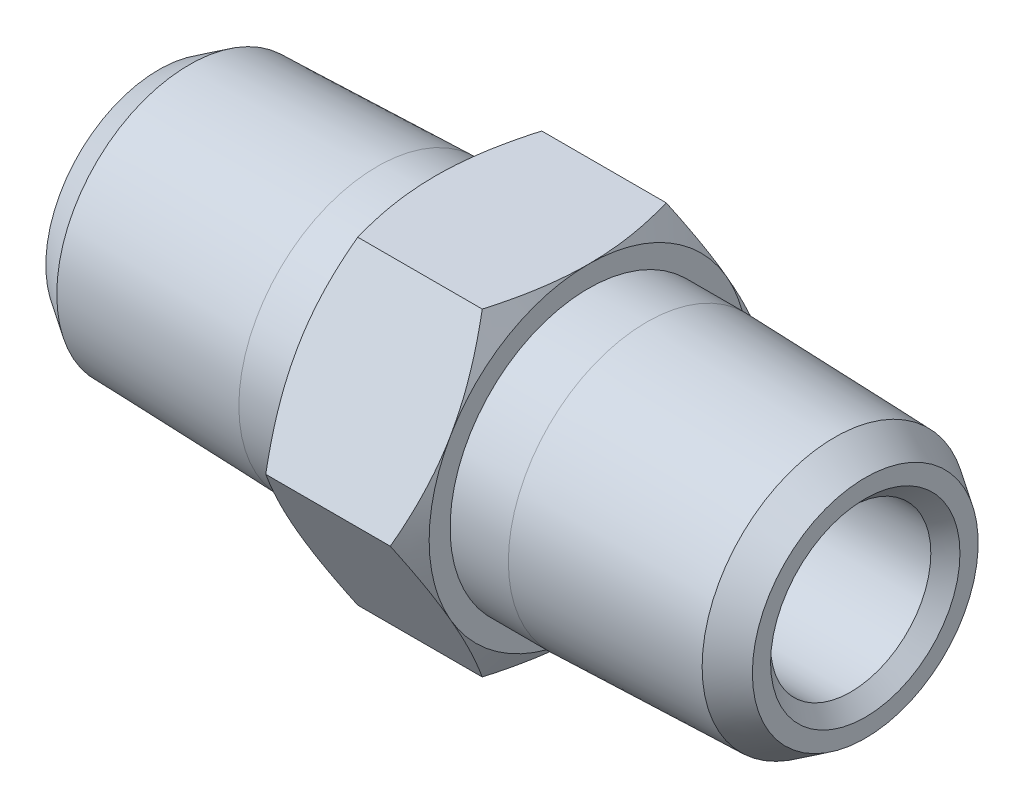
ISO-10303-21;
HEADER;
FILE_DESCRIPTION(('STEP AP214'),'2;1');
FILE_NAME('part.step','',(''),(''),'','','');
FILE_SCHEMA(('AUTOMOTIVE_DESIGN { 1 0 10303 214 1 1 1 1 }'));
ENDSEC;
DATA;
#1=APPLICATION_CONTEXT('core data for automotive mechanical design processes');
#2=APPLICATION_PROTOCOL_DEFINITION('international standard','automotive_design',2000,#1);
#3=PRODUCT_CONTEXT('',#1,'mechanical');
#4=PRODUCT('Part','Part','',(#3));
#5=PRODUCT_RELATED_PRODUCT_CATEGORY('part','',(#4));
#6=PRODUCT_DEFINITION_FORMATION('','',#4);
#7=PRODUCT_DEFINITION_CONTEXT('part definition',#1,'design');
#8=PRODUCT_DEFINITION('design','',#6,#7);
#9=PRODUCT_DEFINITION_SHAPE('','',#8);
#10=(LENGTH_UNIT() NAMED_UNIT(*) SI_UNIT(.MILLI.,.METRE.));
#11=(NAMED_UNIT(*) PLANE_ANGLE_UNIT() SI_UNIT($,.RADIAN.));
#12=(NAMED_UNIT(*) SI_UNIT($,.STERADIAN.) SOLID_ANGLE_UNIT());
#13=UNCERTAINTY_MEASURE_WITH_UNIT(LENGTH_MEASURE(1.E-05),#10,'distance_accuracy_value','');
#14=(GEOMETRIC_REPRESENTATION_CONTEXT(3) GLOBAL_UNCERTAINTY_ASSIGNED_CONTEXT((#13)) GLOBAL_UNIT_ASSIGNED_CONTEXT((#10,
#11,#12)) REPRESENTATION_CONTEXT('',''));
#15=CARTESIAN_POINT('',(0.,0.,0.));
#16=DIRECTION('',(0.,0.,1.));
#17=DIRECTION('',(1.,0.,0.));
#18=AXIS2_PLACEMENT_3D('',#15,#16,#17);
#19=CARTESIAN_POINT('',(0.,0.,-6.41580486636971));
#20=DIRECTION('',(0.,-0.5,-0.866025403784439));
#21=DIRECTION('',(0.,0.866025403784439,-0.5));
#22=AXIS2_PLACEMENT_3D('',#19,#20,#21);
#23=PLANE('',#22);
#24=CARTESIAN_POINT('',(-2.17073577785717,-2.21744281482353E-08,-6.4158048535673));
#25=CARTESIAN_POINT('',(-2.24613408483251,-0.226138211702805,-6.28524390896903));
#26=CARTESIAN_POINT('',(-2.31521209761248,-0.454087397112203,-6.15363738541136));
#27=CARTESIAN_POINT('',(-2.43702992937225,-0.911995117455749,-5.889264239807));
#28=CARTESIAN_POINT('',(-2.4898505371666,-1.14193768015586,-5.75650683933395));
#29=CARTESIAN_POINT('',(-2.55470527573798,-1.48902162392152,-5.55611783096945));
#30=CARTESIAN_POINT('',(-2.57393536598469,-1.60515471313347,-5.4890683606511));
#31=CARTESIAN_POINT('',(-2.60722305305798,-1.8379768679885,-5.35464842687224));
#32=CARTESIAN_POINT('',(-2.62128078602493,-1.95466591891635,-5.28727797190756));
#33=CARTESIAN_POINT('',(-2.64397676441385,-2.18903161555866,-5.15196687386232));
#34=CARTESIAN_POINT('',(-2.65258744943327,-2.30671027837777,-5.08402506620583));
#35=CARTESIAN_POINT('',(-2.66411098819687,-2.54229903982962,-4.94800783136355));
#36=CARTESIAN_POINT('',(-2.66702271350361,-2.66020917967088,-4.87993238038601));
#37=CARTESIAN_POINT('',(-2.66700000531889,-2.77812499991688,-4.81185364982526));
#38=B_SPLINE_CURVE_WITH_KNOTS('',3,(#24,#25,#26,#27,#28,#29,#30,#31,#32,#33,#34,#35,#36,#37),
.UNSPECIFIED.,.F.,.F.,(4,2,2,2,2,2,4),(0.,0.815698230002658,1.62727496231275,2.0335958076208,
2.43990595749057,2.84825580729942,3.25668650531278),.UNSPECIFIED.);
#39=CARTESIAN_POINT('',(-2.17073577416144,1.10872120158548E-08,-6.4158048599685));
#40=VERTEX_POINT('',#39);
#41=CARTESIAN_POINT('',(-2.66700000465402,-2.77812500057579,-4.81185365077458));
#42=VERTEX_POINT('',#41);
#43=EDGE_CURVE('E289',#40,#42,#38,.T.);
#44=ORIENTED_EDGE('',*,*,#43,.F.);
#45=DIRECTION('',(1.,0.,0.));
#46=VECTOR('',#45,1.);
#47=CARTESIAN_POINT('',(0.,0.,-6.4158048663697));
#48=LINE('',#47,#46);
#49=CARTESIAN_POINT('',(2.17073576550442,1.48838510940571E-08,-6.4158048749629));
#50=VERTEX_POINT('',#49);
#51=EDGE_CURVE('E134',#50,#40,#48,.F.);
#52=ORIENTED_EDGE('',*,*,#51,.F.);
#53=CARTESIAN_POINT('',(2.66700000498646,-2.7781249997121,-4.81185364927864));
#54=CARTESIAN_POINT('',(2.66702271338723,-2.66020917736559,-4.87993238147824));
#55=CARTESIAN_POINT('',(2.66411098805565,-2.5422990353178,-4.94800783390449));
#56=CARTESIAN_POINT('',(2.65258744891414,-2.30671026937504,-5.0840250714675));
#57=CARTESIAN_POINT('',(2.64397676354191,-2.18903160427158,-5.15196688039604));
#58=CARTESIAN_POINT('',(2.62128078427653,-1.95466590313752,-5.28727798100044));
#59=CARTESIAN_POINT('',(2.60722305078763,-1.83797685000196,-5.35464843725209));
#60=CARTESIAN_POINT('',(2.57393536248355,-1.60515469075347,-5.48906837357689));
#61=CARTESIAN_POINT('',(2.55470527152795,-1.48902159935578,-5.55611784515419));
#62=CARTESIAN_POINT('',(2.48985053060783,-1.14193764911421,-5.75650685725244));
#63=CARTESIAN_POINT('',(2.4370299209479,-0.911995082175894,-5.88926426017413));
#64=CARTESIAN_POINT('',(2.31521208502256,-0.454087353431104,-6.15363741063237));
#65=CARTESIAN_POINT('',(2.24613406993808,-0.226138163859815,-6.28524393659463));
#66=CARTESIAN_POINT('',(2.17073576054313,2.97677033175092E-08,-6.4158048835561));
#67=B_SPLINE_CURVE_WITH_KNOTS('',3,(#53,#54,#55,#56,#57,#58,#59,#60,#61,#62,#63,#64,#65,#66),
.UNSPECIFIED.,.F.,.F.,(4,2,2,2,2,2,4),(0.,0.408430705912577,0.816780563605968,1.22309072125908,
1.62941157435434,2.44098832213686,3.25668656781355),.UNSPECIFIED.);
#68=CARTESIAN_POINT('',(2.66700000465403,-2.77812500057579,-4.81185365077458));
#69=VERTEX_POINT('',#68);
#70=EDGE_CURVE('E132',#69,#50,#67,.T.);
#71=ORIENTED_EDGE('',*,*,#70,.F.);
#72=CARTESIAN_POINT('',(2.17073579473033,-5.55624992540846,-3.20790247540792));
#73=CARTESIAN_POINT('',(2.24613409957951,-5.33011174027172,-3.3384634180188));
#74=CARTESIAN_POINT('',(2.31521211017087,-5.10216255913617,-3.4700699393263));
#75=CARTESIAN_POINT('',(2.43702993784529,-4.64425484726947,-3.73444308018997));
#76=CARTESIAN_POINT('',(2.48985054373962,-4.41431228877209,-3.86720047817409));
#77=CARTESIAN_POINT('',(2.55470527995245,-4.06722835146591,-4.06758948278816));
#78=CARTESIAN_POINT('',(2.573935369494,-3.95109526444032,-4.13463895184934));
#79=CARTESIAN_POINT('',(2.60722305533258,-3.71827311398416,-4.2690588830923));
#80=CARTESIAN_POINT('',(2.62128078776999,-3.60158406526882,-4.33642933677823));
#81=CARTESIAN_POINT('',(2.64397676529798,-3.36721837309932,-4.47174043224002));
#82=CARTESIAN_POINT('',(2.65258744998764,-3.24953971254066,-4.53968223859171));
#83=CARTESIAN_POINT('',(2.66411098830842,-3.01395095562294,-4.67569947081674));
#84=CARTESIAN_POINT('',(2.66702271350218,-2.89604081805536,-4.74377492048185));
#85=CARTESIAN_POINT('',(2.6670000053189,-2.77812500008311,-4.8118536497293));
#86=B_SPLINE_CURVE_WITH_KNOTS('',3,(#72,#73,#74,#75,#76,#77,#78,#79,#80,#81,#82,#83,#84,#85),
.UNSPECIFIED.,.F.,.F.,(4,2,2,2,2,2,4),(0.,0.815698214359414,1.62727493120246,2.03359576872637,
2.43990591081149,2.84825575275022,3.25668644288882),.UNSPECIFIED.);
#87=CARTESIAN_POINT('',(2.17073576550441,-5.55625,-3.20790245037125));
#88=VERTEX_POINT('',#87);
#89=EDGE_CURVE('E20',#88,#69,#86,.T.);
#90=ORIENTED_EDGE('',*,*,#89,.F.);
#91=DIRECTION('',(1.,0.,0.));
#92=VECTOR('',#91,1.);
#93=CARTESIAN_POINT('',(0.,-5.55625,-3.20790243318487));
#94=LINE('',#93,#92);
#95=CARTESIAN_POINT('',(-2.17073578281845,-5.55624996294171,-3.20790245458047));
#96=VERTEX_POINT('',#95);
#97=EDGE_CURVE('E109',#96,#88,#94,.T.);
#98=ORIENTED_EDGE('',*,*,#97,.F.);
#99=CARTESIAN_POINT('',(-2.66700000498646,-2.7781249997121,-4.81185364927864));
#100=CARTESIAN_POINT('',(-2.66702271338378,-2.89604081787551,-4.74377492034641));
#101=CARTESIAN_POINT('',(-2.66411098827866,-3.01395095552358,-4.67569947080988));
#102=CARTESIAN_POINT('',(-2.65258745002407,-3.24953971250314,-4.53968223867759));
#103=CARTESIAN_POINT('',(-2.64397676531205,-3.36721837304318,-4.4717404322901));
#104=CARTESIAN_POINT('',(-2.62128078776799,-3.60158406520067,-4.33642933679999));
#105=CARTESIAN_POINT('',(-2.60722305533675,-3.71827311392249,-4.26905888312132));
#106=CARTESIAN_POINT('',(-2.57393536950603,-3.9510952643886,-4.13463895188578));
#107=CARTESIAN_POINT('',(-2.55470527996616,-4.06722835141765,-4.06758948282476));
#108=CARTESIAN_POINT('',(-2.48985054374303,-4.41431228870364,-3.86720047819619));
#109=CARTESIAN_POINT('',(-2.43702993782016,-4.64425484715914,-3.73444308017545));
#110=CARTESIAN_POINT('',(-2.31521211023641,-5.10216255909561,-3.47006993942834));
#111=CARTESIAN_POINT('',(-2.24613409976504,-5.3301117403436,-3.33846341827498));
#112=CARTESIAN_POINT('',(-2.17073579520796,-5.5562499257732,-3.20790247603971));
#113=B_SPLINE_CURVE_WITH_KNOTS('',3,(#99,#100,#101,#102,#103,#104,#105,#106,#107,#108,#109,#110,
#111,#112),.UNSPECIFIED.,.F.,.F.,(4,2,2,2,2,2,4),(0.,0.408430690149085,0.81678053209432,
1.22309067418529,1.62941151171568,2.44098822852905,3.25668644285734),.UNSPECIFIED.);
#114=EDGE_CURVE('E192',#42,#96,#113,.T.);
#115=ORIENTED_EDGE('',*,*,#114,.F.);
#116=EDGE_LOOP('',(#44,#52,#71,#90,#98,#115));
#117=FACE_BOUND('',#116,.T.);
#118=ADVANCED_FACE('F16',(#117),#23,.T.);
#119=CARTESIAN_POINT('',(0.,5.55625,-3.20790243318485));
#120=DIRECTION('',(0.,0.5,-0.866025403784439));
#121=DIRECTION('',(0.,0.866025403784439,0.5));
#122=AXIS2_PLACEMENT_3D('',#119,#120,#121);
#123=PLANE('',#122);
#124=CARTESIAN_POINT('',(-2.17073576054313,5.55625002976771,-3.20790241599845));
#125=CARTESIAN_POINT('',(-2.24613406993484,5.3301118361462,-3.33846336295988));
#126=CARTESIAN_POINT('',(-2.31521208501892,5.10216264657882,-3.47006988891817));
#127=CARTESIAN_POINT('',(-2.43702992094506,4.64425491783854,-3.73444303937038));
#128=CARTESIAN_POINT('',(-2.48985053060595,4.41431235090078,-3.86720044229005));
#129=CARTESIAN_POINT('',(-2.55470527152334,4.06722840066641,-4.06758945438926));
#130=CARTESIAN_POINT('',(-2.57393536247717,3.95109530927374,-4.13463892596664));
#131=CARTESIAN_POINT('',(-2.60722305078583,3.71827315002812,-4.26905886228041));
#132=CARTESIAN_POINT('',(-2.62128078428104,3.60158409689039,-4.33642931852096));
#133=CARTESIAN_POINT('',(-2.64397676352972,3.36721839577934,-4.47174041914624));
#134=CARTESIAN_POINT('',(-2.65258744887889,3.24953973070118,-4.53968222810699));
#135=CARTESIAN_POINT('',(-2.66411098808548,3.01395096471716,-4.67569946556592));
#136=CARTESIAN_POINT('',(-2.66702271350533,2.89604082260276,-4.74377491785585));
#137=CARTESIAN_POINT('',(-2.6670000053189,2.7781250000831,-4.81185364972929));
#138=B_SPLINE_CURVE_WITH_KNOTS('',3,(#124,#125,#126,#127,#128,#129,#130,#131,#132,#133,#134,
#135,#136,#137),.UNSPECIFIED.,.F.,.F.,(4,2,2,2,2,2,4),(0.,0.81569824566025,1.62727499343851,
2.03359584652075,2.43990600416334,2.84825586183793,3.25668656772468),.UNSPECIFIED.);
#139=CARTESIAN_POINT('',(-2.17073578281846,5.55625,-3.20790239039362));
#140=VERTEX_POINT('',#139);
#141=CARTESIAN_POINT('',(-2.66700000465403,2.77812500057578,-4.81185365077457));
#142=VERTEX_POINT('',#141);
#143=EDGE_CURVE('E278',#140,#142,#138,.T.);
#144=ORIENTED_EDGE('',*,*,#143,.F.);
#145=DIRECTION('',(1.,0.,0.));
#146=VECTOR('',#145,1.);
#147=CARTESIAN_POINT('',(0.,5.55625,-3.20790243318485));
#148=LINE('',#147,#146);
#149=CARTESIAN_POINT('',(2.17073576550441,5.55625001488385,-3.20790242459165));
#150=VERTEX_POINT('',#149);
#151=EDGE_CURVE('E394',#150,#140,#148,.F.);
#152=ORIENTED_EDGE('',*,*,#151,.F.);
#153=CARTESIAN_POINT('',(2.66700000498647,2.7781249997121,-4.81185364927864));
#154=CARTESIAN_POINT('',(2.66702271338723,2.89604082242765,-4.74377491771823));
#155=CARTESIAN_POINT('',(2.66411098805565,3.0139509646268,-4.67569946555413));
#156=CARTESIAN_POINT('',(2.65258744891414,3.24953973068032,-4.53968222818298));
#157=CARTESIAN_POINT('',(2.64397676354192,3.36721839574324,-4.47174041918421));
#158=CARTESIAN_POINT('',(2.62128078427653,3.60158409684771,-4.33642931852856));
#159=CARTESIAN_POINT('',(2.60722305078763,3.71827314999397,-4.26905886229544));
#160=CARTESIAN_POINT('',(2.57393536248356,3.95109530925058,-4.1346389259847));
#161=CARTESIAN_POINT('',(2.55470527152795,4.06722840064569,-4.06758945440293));
#162=CARTESIAN_POINT('',(2.48985053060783,4.41431235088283,-3.86720044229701));
#163=CARTESIAN_POINT('',(2.4370299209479,4.64425491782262,-3.73444303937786));
#164=CARTESIAN_POINT('',(2.31521208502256,5.10216264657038,-3.47006988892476));
#165=CARTESIAN_POINT('',(2.24613406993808,5.33011183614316,-3.33846336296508));
#166=CARTESIAN_POINT('',(2.17073576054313,5.5562500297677,-3.20790241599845));
#167=B_SPLINE_CURVE_WITH_KNOTS('',3,(#153,#154,#155,#156,#157,#158,#159,#160,#161,#162,#163,
#164,#165,#166),.UNSPECIFIED.,.F.,.F.,(4,2,2,2,2,2,4),(0.,0.408430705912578,0.816780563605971,
1.22309072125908,1.62941157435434,2.44098832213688,3.25668656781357),.UNSPECIFIED.);
#168=CARTESIAN_POINT('',(2.66700000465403,2.77812500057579,-4.81185365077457));
#169=VERTEX_POINT('',#168);
#170=EDGE_CURVE('E327',#169,#150,#167,.T.);
#171=ORIENTED_EDGE('',*,*,#170,.F.);
#172=CARTESIAN_POINT('',(2.17073579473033,7.38620050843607E-08,-6.41580482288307));
#173=CARTESIAN_POINT('',(2.24613409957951,0.226138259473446,-6.28524388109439));
#174=CARTESIAN_POINT('',(2.31521211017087,0.454087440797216,-6.15363736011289));
#175=CARTESIAN_POINT('',(2.4370299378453,0.911995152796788,-5.88926421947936));
#176=CARTESIAN_POINT('',(2.48985054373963,1.14193771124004,-5.7565068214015));
#177=CARTESIAN_POINT('',(2.55470527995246,1.489021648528,-5.55611781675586));
#178=CARTESIAN_POINT('',(2.573935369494,1.60515473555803,-5.48906834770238));
#179=CARTESIAN_POINT('',(2.60722305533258,1.83797688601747,-5.3546484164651));
#180=CARTESIAN_POINT('',(2.62128078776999,1.95466593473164,-5.28727796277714));
#181=CARTESIAN_POINT('',(2.64397676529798,2.1890316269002,-5.15196686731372));
#182=CARTESIAN_POINT('',(2.65258744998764,2.30671028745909,-5.08402506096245));
#183=CARTESIAN_POINT('',(2.66411098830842,2.54229904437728,-4.94800782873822));
#184=CARTESIAN_POINT('',(2.66702271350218,2.6602091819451,-4.87993237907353));
#185=CARTESIAN_POINT('',(2.6670000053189,2.77812499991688,-4.81185364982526));
#186=B_SPLINE_CURVE_WITH_KNOTS('',3,(#172,#173,#174,#175,#176,#177,#178,#179,#180,#181,#182,
#183,#184,#185),.UNSPECIFIED.,.F.,.F.,(4,2,2,2,2,2,4),(0.,0.815698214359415,1.62727493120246,
2.03359576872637,2.4399059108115,2.84825575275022,3.25668644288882),.UNSPECIFIED.);
#187=EDGE_CURVE('E128',#50,#169,#186,.T.);
#188=ORIENTED_EDGE('',*,*,#187,.F.);
#189=ORIENTED_EDGE('',*,*,#51,.T.);
#190=CARTESIAN_POINT('',(-2.66700000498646,2.7781249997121,-4.81185364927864));
#191=CARTESIAN_POINT('',(-2.66702271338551,2.66020917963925,-4.87993238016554));
#192=CARTESIAN_POINT('',(-2.66411098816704,2.54229903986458,-4.9480078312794));
#193=CARTESIAN_POINT('',(-2.65258744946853,2.306710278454,-5.08402506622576));
#194=CARTESIAN_POINT('',(-2.64397676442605,2.18903161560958,-5.15196687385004));
#195=CARTESIAN_POINT('',(-2.62128078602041,1.95466591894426,-5.2872779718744));
#196=CARTESIAN_POINT('',(-2.60722305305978,1.83797686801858,-5.35464842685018));
#197=CARTESIAN_POINT('',(-2.57393536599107,1.60515471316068,-5.48906836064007));
#198=CARTESIAN_POINT('',(-2.55470527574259,1.4890216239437,-5.55611783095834));
#199=CARTESIAN_POINT('',(-2.48985053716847,1.14193768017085,-5.75650683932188));
#200=CARTESIAN_POINT('',(-2.43702992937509,0.91199511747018,-5.88926423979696));
#201=CARTESIAN_POINT('',(-2.31521209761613,0.45408739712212,-6.15363738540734));
#202=CARTESIAN_POINT('',(-2.24613408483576,0.226138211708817,-6.28524390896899));
#203=CARTESIAN_POINT('',(-2.17073577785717,2.21744244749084E-08,-6.41580485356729));
#204=B_SPLINE_CURVE_WITH_KNOTS('',3,(#190,#191,#192,#193,#194,#195,#196,#197,#198,#199,#200,
#201,#202,#203),.UNSPECIFIED.,.F.,.F.,(4,2,2,2,2,2,4),(0.,0.408430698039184,0.816780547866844,
1.22309069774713,1.6294115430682,2.44098827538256,3.25668650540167),.UNSPECIFIED.);
#205=EDGE_CURVE('E293',#142,#40,#204,.T.);
#206=ORIENTED_EDGE('',*,*,#205,.F.);
#207=EDGE_LOOP('',(#144,#152,#171,#188,#189,#206));
#208=FACE_BOUND('',#207,.T.);
#209=ADVANCED_FACE('F300',(#208),#123,.T.);
#210=CARTESIAN_POINT('',(0.,5.55625,3.20790243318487));
#211=DIRECTION('',(0.,1.,0.));
#212=DIRECTION('',(0.,0.,1.));
#213=AXIS2_PLACEMENT_3D('',#210,#211,#212);
#214=PLANE('',#213);
#215=CARTESIAN_POINT('',(-2.17073579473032,5.55624999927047,3.20790234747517));
#216=CARTESIAN_POINT('',(-2.2461340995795,5.55624999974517,2.9467804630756));
#217=CARTESIAN_POINT('',(-2.31521211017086,5.5562499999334,2.6835674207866));
#218=CARTESIAN_POINT('',(-2.43702993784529,5.55625000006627,2.1548211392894));
#219=CARTESIAN_POINT('',(-2.48985054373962,5.55625000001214,1.88930634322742));
#220=CARTESIAN_POINT('',(-2.55470527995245,5.55624999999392,1.48852833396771));
#221=CARTESIAN_POINT('',(-2.57393536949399,5.55624999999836,1.35442939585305));
#222=CARTESIAN_POINT('',(-2.60722305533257,5.55625000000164,1.08558953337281));
#223=CARTESIAN_POINT('',(-2.62128078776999,5.55625000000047,0.950848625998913));
#224=CARTESIAN_POINT('',(-2.64397676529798,5.55624999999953,0.680226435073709));
#225=CARTESIAN_POINT('',(-2.65258744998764,5.55624999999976,0.544342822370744));
#226=CARTESIAN_POINT('',(-2.66411098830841,5.55625000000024,0.27230835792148));
#227=CARTESIAN_POINT('',(-2.66702271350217,5.55625000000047,0.136157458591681));
#228=CARTESIAN_POINT('',(-2.66700000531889,5.55625,9.59636370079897E-11));
#229=B_SPLINE_CURVE_WITH_KNOTS('',3,(#215,#216,#217,#218,#219,#220,#221,#222,#223,#224,#225,
#226,#227,#228),.UNSPECIFIED.,.F.,.F.,(4,2,2,2,2,2,4),(0.,0.815698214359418,1.62727493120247,
2.03359576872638,2.43990591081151,2.84825575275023,3.25668644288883),.UNSPECIFIED.);
#230=CARTESIAN_POINT('',(-2.17073576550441,5.55625001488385,3.20790242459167));
#231=VERTEX_POINT('',#230);
#232=CARTESIAN_POINT('',(-2.66700000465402,5.55625000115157,0.));
#233=VERTEX_POINT('',#232);
#234=EDGE_CURVE('E258',#231,#233,#229,.T.);
#235=ORIENTED_EDGE('',*,*,#234,.F.);
#236=DIRECTION('',(1.,0.,0.));
#237=VECTOR('',#236,1.);
#238=CARTESIAN_POINT('',(0.,5.55625,3.20790243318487));
#239=LINE('',#238,#237);
#240=CARTESIAN_POINT('',(2.17073578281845,5.55625,3.20790239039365));
#241=VERTEX_POINT('',#240);
#242=EDGE_CURVE('E396',#241,#231,#239,.F.);
#243=ORIENTED_EDGE('',*,*,#242,.F.);
#244=CARTESIAN_POINT('',(2.66700000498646,5.55624999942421,0.));
#245=CARTESIAN_POINT('',(2.66702271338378,5.55624999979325,0.136157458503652));
#246=CARTESIAN_POINT('',(2.66411098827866,5.55624999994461,0.272308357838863));
#247=CARTESIAN_POINT('',(2.65258745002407,5.55625000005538,0.544342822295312));
#248=CARTESIAN_POINT('',(2.64397676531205,5.55625000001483,0.680226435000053));
#249=CARTESIAN_POINT('',(2.62128078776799,5.55624999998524,0.950848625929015));
#250=CARTESIAN_POINT('',(2.60722305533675,5.55624999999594,1.08558953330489));
#251=CARTESIAN_POINT('',(2.57393536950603,5.55625000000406,1.35442939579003));
#252=CARTESIAN_POINT('',(2.55470527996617,5.55625000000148,1.48852833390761));
#253=CARTESIAN_POINT('',(2.48985054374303,5.55624999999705,1.8893063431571));
#254=CARTESIAN_POINT('',(2.43702993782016,5.55624999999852,2.15482113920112));
#255=CARTESIAN_POINT('',(2.31521211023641,5.55625000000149,2.68356742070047));
#256=CARTESIAN_POINT('',(2.24613409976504,5.55625000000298,2.94678046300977));
#257=CARTESIAN_POINT('',(2.17073579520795,5.55625,3.20790234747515));
#258=B_SPLINE_CURVE_WITH_KNOTS('',3,(#244,#245,#246,#247,#248,#249,#250,#251,#252,#253,#254,
#255,#256,#257),.UNSPECIFIED.,.F.,.F.,(4,2,2,2,2,2,4),(0.,0.408430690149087,0.816780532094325,
1.2230906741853,1.62941151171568,2.44098822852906,3.25668644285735),.UNSPECIFIED.);
#259=CARTESIAN_POINT('',(2.66700000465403,5.55625000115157,0.));
#260=VERTEX_POINT('',#259);
#261=EDGE_CURVE('E332',#260,#241,#258,.T.);
#262=ORIENTED_EDGE('',*,*,#261,.F.);
#263=CARTESIAN_POINT('',(2.17073579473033,5.55624999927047,-3.20790234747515));
#264=CARTESIAN_POINT('',(2.2461340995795,5.55624999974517,-2.94678046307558));
#265=CARTESIAN_POINT('',(2.31521211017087,5.5562499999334,-2.68356742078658));
#266=CARTESIAN_POINT('',(2.43702993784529,5.55625000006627,-2.15482113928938));
#267=CARTESIAN_POINT('',(2.48985054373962,5.55625000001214,-1.88930634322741));
#268=CARTESIAN_POINT('',(2.55470527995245,5.55624999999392,-1.4885283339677));
#269=CARTESIAN_POINT('',(2.57393536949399,5.55624999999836,-1.35442939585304));
#270=CARTESIAN_POINT('',(2.60722305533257,5.55625000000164,-1.0855895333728));
#271=CARTESIAN_POINT('',(2.62128078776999,5.55625000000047,-0.950848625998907));
#272=CARTESIAN_POINT('',(2.64397676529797,5.55624999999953,-0.680226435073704));
#273=CARTESIAN_POINT('',(2.65258744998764,5.55624999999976,-0.54434282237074));
#274=CARTESIAN_POINT('',(2.66411098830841,5.55625000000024,-0.272308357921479));
#275=CARTESIAN_POINT('',(2.66702271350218,5.55625000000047,-0.136157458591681));
#276=CARTESIAN_POINT('',(2.66700000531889,5.55625,-9.5964062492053E-11));
#277=B_SPLINE_CURVE_WITH_KNOTS('',3,(#263,#264,#265,#266,#267,#268,#269,#270,#271,#272,#273,
#274,#275,#276),.UNSPECIFIED.,.F.,.F.,(4,2,2,2,2,2,4),(0.,0.815698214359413,1.62727493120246,
2.03359576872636,2.43990591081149,2.84825575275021,3.25668644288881),.UNSPECIFIED.);
#278=EDGE_CURVE('E137',#150,#260,#277,.T.);
#279=ORIENTED_EDGE('',*,*,#278,.F.);
#280=ORIENTED_EDGE('',*,*,#151,.T.);
#281=CARTESIAN_POINT('',(-2.66700000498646,5.55624999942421,0.));
#282=CARTESIAN_POINT('',(-2.66702271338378,5.55624999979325,-0.136157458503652));
#283=CARTESIAN_POINT('',(-2.66411098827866,5.55624999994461,-0.272308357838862));
#284=CARTESIAN_POINT('',(-2.65258745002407,5.55625000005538,-0.544342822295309));
#285=CARTESIAN_POINT('',(-2.64397676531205,5.55625000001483,-0.680226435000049));
#286=CARTESIAN_POINT('',(-2.62128078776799,5.55624999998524,-0.95084862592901));
#287=CARTESIAN_POINT('',(-2.60722305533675,5.55624999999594,-1.08558953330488));
#288=CARTESIAN_POINT('',(-2.57393536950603,5.55625000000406,-1.35442939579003));
#289=CARTESIAN_POINT('',(-2.55470527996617,5.55625000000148,-1.4885283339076));
#290=CARTESIAN_POINT('',(-2.48985054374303,5.55624999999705,-1.88930634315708));
#291=CARTESIAN_POINT('',(-2.43702993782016,5.55624999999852,-2.15482113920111));
#292=CARTESIAN_POINT('',(-2.31521211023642,5.55625000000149,-2.68356742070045));
#293=CARTESIAN_POINT('',(-2.24613409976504,5.55625000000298,-2.94678046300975));
#294=CARTESIAN_POINT('',(-2.17073579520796,5.55625,-3.20790234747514));
#295=B_SPLINE_CURVE_WITH_KNOTS('',3,(#281,#282,#283,#284,#285,#286,#287,#288,#289,#290,#291,
#292,#293,#294),.UNSPECIFIED.,.F.,.F.,(4,2,2,2,2,2,4),(0.,0.408430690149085,0.81678053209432,
1.22309067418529,1.62941151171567,2.44098822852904,3.25668644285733),.UNSPECIFIED.);
#296=EDGE_CURVE('E283',#233,#140,#295,.T.);
#297=ORIENTED_EDGE('',*,*,#296,.F.);
#298=EDGE_LOOP('',(#235,#243,#262,#279,#280,#297));
#299=FACE_BOUND('',#298,.T.);
#300=ADVANCED_FACE('F238',(#299),#214,.T.);
#301=CARTESIAN_POINT('',(0.,0.,6.41580486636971));
#302=DIRECTION('',(0.,0.5,0.866025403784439));
#303=DIRECTION('',(0.,-0.866025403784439,0.5));
#304=AXIS2_PLACEMENT_3D('',#301,#302,#303);
#305=PLANE('',#304);
#306=DIRECTION('',(1.,0.,0.));
#307=VECTOR('',#306,1.);
#308=CARTESIAN_POINT('',(0.,0.,6.41580486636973));
#309=LINE('',#308,#307);
#310=CARTESIAN_POINT('',(2.17073577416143,1.10872094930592E-08,6.41580485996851));
#311=VERTEX_POINT('',#310);
#312=CARTESIAN_POINT('',(-2.1707357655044,1.48838426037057E-08,6.41580487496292));
#313=VERTEX_POINT('',#312);
#314=EDGE_CURVE('E351',#311,#313,#309,.F.);
#315=ORIENTED_EDGE('',*,*,#314,.F.);
#316=CARTESIAN_POINT('',(2.66700000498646,2.7781249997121,4.81185364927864));
#317=CARTESIAN_POINT('',(2.66702271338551,2.66020917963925,4.87993238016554));
#318=CARTESIAN_POINT('',(2.66411098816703,2.54229903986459,4.94800783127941));
#319=CARTESIAN_POINT('',(2.65258744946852,2.306710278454,5.08402506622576));
#320=CARTESIAN_POINT('',(2.64397676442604,2.18903161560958,5.15196687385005));
#321=CARTESIAN_POINT('',(2.62128078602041,1.95466591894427,5.28727797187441));
#322=CARTESIAN_POINT('',(2.60722305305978,1.83797686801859,5.35464842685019));
#323=CARTESIAN_POINT('',(2.57393536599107,1.60515471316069,5.48906836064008));
#324=CARTESIAN_POINT('',(2.55470527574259,1.48902162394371,5.55611783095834));
#325=CARTESIAN_POINT('',(2.48985053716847,1.14193768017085,5.75650683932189));
#326=CARTESIAN_POINT('',(2.43702992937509,0.911995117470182,5.88926423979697));
#327=CARTESIAN_POINT('',(2.31521209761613,0.454087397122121,6.15363738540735));
#328=CARTESIAN_POINT('',(2.24613408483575,0.226138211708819,6.285243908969));
#329=CARTESIAN_POINT('',(2.17073577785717,2.21744253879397E-08,6.4158048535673));
#330=B_SPLINE_CURVE_WITH_KNOTS('',3,(#316,#317,#318,#319,#320,#321,#322,#323,#324,#325,#326,
#327,#328,#329),.UNSPECIFIED.,.F.,.F.,(4,2,2,2,2,2,4),(0.,0.408430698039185,0.816780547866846,
1.22309069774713,1.62941154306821,2.44098827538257,3.25668650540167),.UNSPECIFIED.);
#331=CARTESIAN_POINT('',(2.66700000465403,2.77812500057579,4.81185365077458));
#332=VERTEX_POINT('',#331);
#333=EDGE_CURVE('E224',#332,#311,#330,.T.);
#334=ORIENTED_EDGE('',*,*,#333,.F.);
#335=CARTESIAN_POINT('',(2.17073576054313,5.5562500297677,3.20790241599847));
#336=CARTESIAN_POINT('',(2.24613406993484,5.33011183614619,3.3384633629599));
#337=CARTESIAN_POINT('',(2.31521208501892,5.10216264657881,3.47006988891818));
#338=CARTESIAN_POINT('',(2.43702992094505,4.64425491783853,3.73444303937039));
#339=CARTESIAN_POINT('',(2.48985053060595,4.41431235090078,3.86720044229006));
#340=CARTESIAN_POINT('',(2.55470527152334,4.06722840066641,4.06758945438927));
#341=CARTESIAN_POINT('',(2.57393536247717,3.95109530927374,4.13463892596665));
#342=CARTESIAN_POINT('',(2.60722305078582,3.71827315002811,4.26905886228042));
#343=CARTESIAN_POINT('',(2.62128078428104,3.60158409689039,4.33642931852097));
#344=CARTESIAN_POINT('',(2.64397676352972,3.36721839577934,4.47174041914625));
#345=CARTESIAN_POINT('',(2.65258744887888,3.24953973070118,4.539682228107));
#346=CARTESIAN_POINT('',(2.66411098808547,3.01395096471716,4.67569946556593));
#347=CARTESIAN_POINT('',(2.66702271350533,2.89604082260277,4.74377491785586));
#348=CARTESIAN_POINT('',(2.66700000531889,2.77812500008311,4.81185364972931));
#349=B_SPLINE_CURVE_WITH_KNOTS('',3,(#335,#336,#337,#338,#339,#340,#341,#342,#343,#344,#345,
#346,#347,#348),.UNSPECIFIED.,.F.,.F.,(4,2,2,2,2,2,4),(0.,0.815698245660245,1.6272749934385,
2.03359584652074,2.43990600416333,2.84825586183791,3.25668656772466),.UNSPECIFIED.);
#350=EDGE_CURVE('E229',#241,#332,#349,.T.);
#351=ORIENTED_EDGE('',*,*,#350,.F.);
#352=ORIENTED_EDGE('',*,*,#242,.T.);
#353=CARTESIAN_POINT('',(-2.66700000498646,2.7781249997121,4.81185364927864));
#354=CARTESIAN_POINT('',(-2.66702271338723,2.89604082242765,4.74377491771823));
#355=CARTESIAN_POINT('',(-2.66411098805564,3.01395096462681,4.67569946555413));
#356=CARTESIAN_POINT('',(-2.65258744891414,3.24953973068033,4.53968222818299));
#357=CARTESIAN_POINT('',(-2.64397676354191,3.36721839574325,4.47174041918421));
#358=CARTESIAN_POINT('',(-2.62128078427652,3.60158409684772,4.33642931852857));
#359=CARTESIAN_POINT('',(-2.60722305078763,3.71827314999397,4.26905886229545));
#360=CARTESIAN_POINT('',(-2.57393536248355,3.95109530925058,4.13463892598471));
#361=CARTESIAN_POINT('',(-2.55470527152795,4.06722840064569,4.06758945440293));
#362=CARTESIAN_POINT('',(-2.48985053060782,4.41431235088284,3.86720044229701));
#363=CARTESIAN_POINT('',(-2.4370299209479,4.64425491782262,3.73444303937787));
#364=CARTESIAN_POINT('',(-2.31521208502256,5.10216264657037,3.47006988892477));
#365=CARTESIAN_POINT('',(-2.24613406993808,5.33011183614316,3.33846336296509));
#366=CARTESIAN_POINT('',(-2.17073576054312,5.5562500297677,3.20790241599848));
#367=B_SPLINE_CURVE_WITH_KNOTS('',3,(#353,#354,#355,#356,#357,#358,#359,#360,#361,#362,#363,
#364,#365,#366),.UNSPECIFIED.,.F.,.F.,(4,2,2,2,2,2,4),(0.,0.408430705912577,0.816780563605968,
1.22309072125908,1.62941157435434,2.44098832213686,3.25668656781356),.UNSPECIFIED.);
#368=CARTESIAN_POINT('',(-2.66700000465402,2.77812500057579,4.81185365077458));
#369=VERTEX_POINT('',#368);
#370=EDGE_CURVE('E251',#369,#231,#367,.T.);
#371=ORIENTED_EDGE('',*,*,#370,.F.);
#372=CARTESIAN_POINT('',(-2.17073579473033,7.3862004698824E-08,6.41580482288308));
#373=CARTESIAN_POINT('',(-2.2461340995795,0.226138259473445,6.2852438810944));
#374=CARTESIAN_POINT('',(-2.31521211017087,0.454087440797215,6.1536373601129));
#375=CARTESIAN_POINT('',(-2.43702993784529,0.911995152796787,5.88926421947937));
#376=CARTESIAN_POINT('',(-2.48985054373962,1.14193771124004,5.75650682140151));
#377=CARTESIAN_POINT('',(-2.55470527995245,1.489021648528,5.55611781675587));
#378=CARTESIAN_POINT('',(-2.573935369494,1.60515473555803,5.48906834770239));
#379=CARTESIAN_POINT('',(-2.60722305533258,1.83797688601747,5.35464841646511));
#380=CARTESIAN_POINT('',(-2.62128078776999,1.95466593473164,5.28727796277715));
#381=CARTESIAN_POINT('',(-2.64397676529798,2.1890316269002,5.15196686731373));
#382=CARTESIAN_POINT('',(-2.65258744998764,2.30671028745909,5.08402506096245));
#383=CARTESIAN_POINT('',(-2.66411098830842,2.54229904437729,4.94800782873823));
#384=CARTESIAN_POINT('',(-2.66702271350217,2.66020918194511,4.87993237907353));
#385=CARTESIAN_POINT('',(-2.66700000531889,2.77812499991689,4.81185364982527));
#386=B_SPLINE_CURVE_WITH_KNOTS('',3,(#372,#373,#374,#375,#376,#377,#378,#379,#380,#381,#382,
#383,#384,#385),.UNSPECIFIED.,.F.,.F.,(4,2,2,2,2,2,4),(0.,0.815698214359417,1.62727493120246,
2.03359576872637,2.4399059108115,2.84825575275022,3.25668644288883),.UNSPECIFIED.);
#387=EDGE_CURVE('E246',#313,#369,#386,.T.);
#388=ORIENTED_EDGE('',*,*,#387,.F.);
#389=EDGE_LOOP('',(#315,#334,#351,#352,#371,#388));
#390=FACE_BOUND('',#389,.T.);
#391=ADVANCED_FACE('F234',(#390),#305,.T.);
#392=CARTESIAN_POINT('',(0.,-5.55625,3.20790243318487));
#393=DIRECTION('',(0.,-0.5,0.866025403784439));
#394=DIRECTION('',(0.,-0.866025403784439,-0.5));
#395=AXIS2_PLACEMENT_3D('',#392,#393,#394);
#396=PLANE('',#395);
#397=DIRECTION('',(1.,0.,0.));
#398=VECTOR('',#397,1.);
#399=CARTESIAN_POINT('',(0.,-5.55625,3.20790243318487));
#400=LINE('',#399,#398);
#401=CARTESIAN_POINT('',(2.17073578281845,-5.55624996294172,3.20790245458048));
#402=VERTEX_POINT('',#401);
#403=CARTESIAN_POINT('',(-2.17073576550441,-5.55625,3.20790245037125));
#404=VERTEX_POINT('',#403);
#405=EDGE_CURVE('E120',#402,#404,#400,.F.);
#406=ORIENTED_EDGE('',*,*,#405,.F.);
#407=CARTESIAN_POINT('',(2.66700000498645,-2.77812499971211,4.81185364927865));
#408=CARTESIAN_POINT('',(2.66702271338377,-2.89604081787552,4.74377492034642));
#409=CARTESIAN_POINT('',(2.66411098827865,-3.01395095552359,4.6756994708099));
#410=CARTESIAN_POINT('',(2.65258745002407,-3.24953971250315,4.5396822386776));
#411=CARTESIAN_POINT('',(2.64397676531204,-3.36721837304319,4.47174043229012));
#412=CARTESIAN_POINT('',(2.62128078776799,-3.60158406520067,4.33642933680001));
#413=CARTESIAN_POINT('',(2.60722305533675,-3.7182731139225,4.26905888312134));
#414=CARTESIAN_POINT('',(2.57393536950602,-3.95109526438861,4.1346389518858));
#415=CARTESIAN_POINT('',(2.55470527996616,-4.06722835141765,4.06758948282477));
#416=CARTESIAN_POINT('',(2.48985054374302,-4.41431228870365,3.8672004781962));
#417=CARTESIAN_POINT('',(2.43702993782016,-4.64425484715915,3.73444308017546));
#418=CARTESIAN_POINT('',(2.31521211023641,-5.10216255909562,3.47006993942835));
#419=CARTESIAN_POINT('',(2.24613409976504,-5.33011174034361,3.338463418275));
#420=CARTESIAN_POINT('',(2.17073579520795,-5.55624992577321,3.20790247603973));
#421=B_SPLINE_CURVE_WITH_KNOTS('',3,(#407,#408,#409,#410,#411,#412,#413,#414,#415,#416,#417,
#418,#419,#420),.UNSPECIFIED.,.F.,.F.,(4,2,2,2,2,2,4),(0.,0.408430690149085,0.816780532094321,
1.22309067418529,1.62941151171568,2.44098822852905,3.25668644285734),.UNSPECIFIED.);
#422=CARTESIAN_POINT('',(2.66700000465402,-2.77812500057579,4.81185365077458));
#423=VERTEX_POINT('',#422);
#424=EDGE_CURVE('E193',#423,#402,#421,.T.);
#425=ORIENTED_EDGE('',*,*,#424,.F.);
#426=CARTESIAN_POINT('',(2.17073577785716,-2.21744375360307E-08,6.41580485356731));
#427=CARTESIAN_POINT('',(2.24613408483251,-0.226138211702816,6.28524390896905));
#428=CARTESIAN_POINT('',(2.31521209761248,-0.454087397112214,6.15363738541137));
#429=CARTESIAN_POINT('',(2.43702992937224,-0.911995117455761,5.88926423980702));
#430=CARTESIAN_POINT('',(2.48985053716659,-1.14193768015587,5.75650683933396));
#431=CARTESIAN_POINT('',(2.55470527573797,-1.48902162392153,5.55611783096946));
#432=CARTESIAN_POINT('',(2.57393536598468,-1.60515471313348,5.48906836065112));
#433=CARTESIAN_POINT('',(2.60722305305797,-1.83797686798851,5.35464842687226));
#434=CARTESIAN_POINT('',(2.62128078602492,-1.95466591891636,5.28727797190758));
#435=CARTESIAN_POINT('',(2.64397676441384,-2.18903161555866,5.15196687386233));
#436=CARTESIAN_POINT('',(2.65258744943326,-2.30671027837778,5.08402506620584));
#437=CARTESIAN_POINT('',(2.66411098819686,-2.54229903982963,4.94800783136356));
#438=CARTESIAN_POINT('',(2.6670227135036,-2.66020917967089,4.87993238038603));
#439=CARTESIAN_POINT('',(2.66700000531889,-2.77812499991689,4.81185364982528));
#440=B_SPLINE_CURVE_WITH_KNOTS('',3,(#426,#427,#428,#429,#430,#431,#432,#433,#434,#435,#436,
#437,#438,#439),.UNSPECIFIED.,.F.,.F.,(4,2,2,2,2,2,4),(0.,0.815698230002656,1.62727496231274,
2.0335958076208,2.43990595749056,2.84825580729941,3.25668650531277),.UNSPECIFIED.);
#441=EDGE_CURVE('E219',#311,#423,#440,.T.);
#442=ORIENTED_EDGE('',*,*,#441,.F.);
#443=ORIENTED_EDGE('',*,*,#314,.T.);
#444=CARTESIAN_POINT('',(-2.66700000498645,-2.77812499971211,4.81185364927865));
#445=CARTESIAN_POINT('',(-2.66702271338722,-2.6602091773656,4.87993238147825));
#446=CARTESIAN_POINT('',(-2.66411098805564,-2.5422990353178,4.94800783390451));
#447=CARTESIAN_POINT('',(-2.65258744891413,-2.30671026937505,5.08402507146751));
#448=CARTESIAN_POINT('',(-2.6439767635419,-2.18903160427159,5.15196688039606));
#449=CARTESIAN_POINT('',(-2.62128078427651,-1.95466590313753,5.28727798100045));
#450=CARTESIAN_POINT('',(-2.60722305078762,-1.83797685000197,5.3546484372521));
#451=CARTESIAN_POINT('',(-2.57393536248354,-1.60515469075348,5.4890683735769));
#452=CARTESIAN_POINT('',(-2.55470527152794,-1.48902159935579,5.5561178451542));
#453=CARTESIAN_POINT('',(-2.48985053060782,-1.14193764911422,5.75650685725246));
#454=CARTESIAN_POINT('',(-2.43702992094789,-0.911995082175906,5.88926426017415));
#455=CARTESIAN_POINT('',(-2.31521208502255,-0.454087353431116,6.15363741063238));
#456=CARTESIAN_POINT('',(-2.24613406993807,-0.226138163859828,6.28524393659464));
#457=CARTESIAN_POINT('',(-2.17073576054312,2.97676907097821E-08,6.41580488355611));
#458=B_SPLINE_CURVE_WITH_KNOTS('',3,(#444,#445,#446,#447,#448,#449,#450,#451,#452,#453,#454,
#455,#456,#457),.UNSPECIFIED.,.F.,.F.,(4,2,2,2,2,2,4),(0.,0.408430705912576,0.816780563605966,
1.22309072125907,1.62941157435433,2.44098832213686,3.25668656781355),.UNSPECIFIED.);
#459=CARTESIAN_POINT('',(-2.66700000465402,-2.77812500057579,4.81185365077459));
#460=VERTEX_POINT('',#459);
#461=EDGE_CURVE('E687',#460,#313,#458,.T.);
#462=ORIENTED_EDGE('',*,*,#461,.F.);
#463=CARTESIAN_POINT('',(-2.17073579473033,-5.55624992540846,3.20790247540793));
#464=CARTESIAN_POINT('',(-2.24613409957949,-5.33011174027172,3.33846341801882));
#465=CARTESIAN_POINT('',(-2.31521211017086,-5.10216255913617,3.47006993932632));
#466=CARTESIAN_POINT('',(-2.43702993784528,-4.64425484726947,3.73444308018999));
#467=CARTESIAN_POINT('',(-2.48985054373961,-4.4143122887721,3.86720047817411));
#468=CARTESIAN_POINT('',(-2.55470527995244,-4.06722835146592,4.06758948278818));
#469=CARTESIAN_POINT('',(-2.57393536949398,-3.95109526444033,4.13463895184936));
#470=CARTESIAN_POINT('',(-2.60722305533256,-3.71827311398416,4.26905888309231));
#471=CARTESIAN_POINT('',(-2.62128078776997,-3.60158406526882,4.33642933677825));
#472=CARTESIAN_POINT('',(-2.64397676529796,-3.36721837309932,4.47174043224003));
#473=CARTESIAN_POINT('',(-2.65258744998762,-3.24953971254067,4.53968223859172));
#474=CARTESIAN_POINT('',(-2.6641109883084,-3.01395095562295,4.67569947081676));
#475=CARTESIAN_POINT('',(-2.66702271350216,-2.89604081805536,4.74377492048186));
#476=CARTESIAN_POINT('',(-2.66700000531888,-2.77812500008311,4.81185364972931));
#477=B_SPLINE_CURVE_WITH_KNOTS('',3,(#463,#464,#465,#466,#467,#468,#469,#470,#471,#472,#473,
#474,#475,#476),.UNSPECIFIED.,.F.,.F.,(4,2,2,2,2,2,4),(0.,0.815698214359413,1.62727493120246,
2.03359576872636,2.43990591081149,2.84825575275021,3.25668644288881),.UNSPECIFIED.);
#478=EDGE_CURVE('E40',#404,#460,#477,.T.);
#479=ORIENTED_EDGE('',*,*,#478,.F.);
#480=EDGE_LOOP('',(#406,#425,#442,#443,#462,#479));
#481=FACE_BOUND('',#480,.T.);
#482=ADVANCED_FACE('F170',(#481),#396,.T.);
#483=CARTESIAN_POINT('',(0.,-5.55625,-3.20790243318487));
#484=DIRECTION('',(0.,-1.,0.));
#485=DIRECTION('',(0.,0.,-1.));
#486=AXIS2_PLACEMENT_3D('',#483,#484,#485);
#487=PLANE('',#486);
#488=ORIENTED_EDGE('',*,*,#97,.T.);
#489=CARTESIAN_POINT('',(2.66700000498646,-5.55624999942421,0.));
#490=CARTESIAN_POINT('',(2.66702271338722,-5.55624999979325,-0.136157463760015));
#491=CARTESIAN_POINT('',(2.66411098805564,-5.55624999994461,-0.272308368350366));
#492=CARTESIAN_POINT('',(2.65258744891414,-5.55625000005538,-0.544342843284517));
#493=CARTESIAN_POINT('',(2.64397676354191,-5.55625000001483,-0.680226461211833));
#494=CARTESIAN_POINT('',(2.62128078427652,-5.55624999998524,-0.950848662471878));
#495=CARTESIAN_POINT('',(2.60722305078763,-5.55624999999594,-1.08558957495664));
#496=CARTESIAN_POINT('',(2.57393536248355,-5.55625000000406,-1.35442944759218));
#497=CARTESIAN_POINT('',(2.55470527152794,-5.55625000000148,-1.48852839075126));
#498=CARTESIAN_POINT('',(2.48985053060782,-5.55624999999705,-1.88930641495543));
#499=CARTESIAN_POINT('',(2.43702992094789,-5.55624999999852,-2.15482122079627));
#500=CARTESIAN_POINT('',(2.31521208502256,-5.55625000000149,-2.6835675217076));
#501=CARTESIAN_POINT('',(2.24613406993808,-5.55625000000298,-2.94678057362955));
#502=CARTESIAN_POINT('',(2.17073576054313,-5.55625,-3.20790246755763));
#503=B_SPLINE_CURVE_WITH_KNOTS('',3,(#489,#490,#491,#492,#493,#494,#495,#496,#497,#498,#499,
#500,#501,#502),.UNSPECIFIED.,.F.,.F.,(4,2,2,2,2,2,4),(0.,0.408430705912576,0.816780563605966,
1.22309072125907,1.62941157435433,2.44098832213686,3.25668656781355),.UNSPECIFIED.);
#504=CARTESIAN_POINT('',(2.66700000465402,-5.55625000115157,0.));
#505=VERTEX_POINT('',#504);
#506=EDGE_CURVE('E113',#505,#88,#503,.T.);
#507=ORIENTED_EDGE('',*,*,#506,.F.);
#508=CARTESIAN_POINT('',(2.17073576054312,-5.55625,3.20790246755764));
#509=CARTESIAN_POINT('',(2.24613406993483,-5.55625,2.94678057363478));
#510=CARTESIAN_POINT('',(2.31521208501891,-5.55625,2.68356752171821));
#511=CARTESIAN_POINT('',(2.43702992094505,-5.55625,2.15482122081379));
#512=CARTESIAN_POINT('',(2.48985053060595,-5.55625,1.88930641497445));
#513=CARTESIAN_POINT('',(2.55470527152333,-5.55625,1.48852839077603));
#514=CARTESIAN_POINT('',(2.57393536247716,-5.55625,1.35442944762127));
#515=CARTESIAN_POINT('',(2.60722305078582,-5.55625,1.08558957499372));
#516=CARTESIAN_POINT('',(2.62128078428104,-5.55625,0.95084866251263));
#517=CARTESIAN_POINT('',(2.64397676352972,-5.55625,0.680226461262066));
#518=CARTESIAN_POINT('',(2.65258744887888,-5.55625,0.544342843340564));
#519=CARTESIAN_POINT('',(2.66411098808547,-5.55625,0.272308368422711));
#520=CARTESIAN_POINT('',(2.66702271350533,-5.55625,0.136157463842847));
#521=CARTESIAN_POINT('',(2.66700000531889,-5.55625,9.59610182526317E-11));
#522=B_SPLINE_CURVE_WITH_KNOTS('',3,(#508,#509,#510,#511,#512,#513,#514,#515,#516,#517,#518,
#519,#520,#521),.UNSPECIFIED.,.F.,.F.,(4,2,2,2,2,2,4),(0.,0.815698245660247,1.6272749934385,
2.03359584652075,2.43990600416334,2.84825586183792,3.25668656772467),.UNSPECIFIED.);
#523=EDGE_CURVE('E186',#402,#505,#522,.T.);
#524=ORIENTED_EDGE('',*,*,#523,.F.);
#525=ORIENTED_EDGE('',*,*,#405,.T.);
#526=CARTESIAN_POINT('',(-2.66700000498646,-5.55624999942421,0.));
#527=CARTESIAN_POINT('',(-2.66702271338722,-5.55624999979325,0.136157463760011));
#528=CARTESIAN_POINT('',(-2.66411098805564,-5.55624999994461,0.272308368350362));
#529=CARTESIAN_POINT('',(-2.65258744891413,-5.55625000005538,0.544342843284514));
#530=CARTESIAN_POINT('',(-2.6439767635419,-5.55625000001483,0.68022646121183));
#531=CARTESIAN_POINT('',(-2.62128078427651,-5.55624999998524,0.950848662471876));
#532=CARTESIAN_POINT('',(-2.60722305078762,-5.55624999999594,1.08558957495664));
#533=CARTESIAN_POINT('',(-2.57393536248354,-5.55625000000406,1.35442944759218));
#534=CARTESIAN_POINT('',(-2.55470527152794,-5.55625000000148,1.48852839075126));
#535=CARTESIAN_POINT('',(-2.48985053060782,-5.55624999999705,1.88930641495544));
#536=CARTESIAN_POINT('',(-2.43702992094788,-5.55624999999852,2.15482122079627));
#537=CARTESIAN_POINT('',(-2.31521208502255,-5.55625000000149,2.68356752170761));
#538=CARTESIAN_POINT('',(-2.24613406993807,-5.55625000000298,2.94678057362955));
#539=CARTESIAN_POINT('',(-2.17073576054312,-5.55625,3.20790246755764));
#540=B_SPLINE_CURVE_WITH_KNOTS('',3,(#526,#527,#528,#529,#530,#531,#532,#533,#534,#535,#536,
#537,#538,#539),.UNSPECIFIED.,.F.,.F.,(4,2,2,2,2,2,4),(0.,0.408430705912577,0.816780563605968,
1.22309072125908,1.62941157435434,2.44098832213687,3.25668656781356),.UNSPECIFIED.);
#541=CARTESIAN_POINT('',(-2.66700000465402,-5.55625000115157,0.));
#542=VERTEX_POINT('',#541);
#543=EDGE_CURVE('E149',#542,#404,#540,.T.);
#544=ORIENTED_EDGE('',*,*,#543,.F.);
#545=CARTESIAN_POINT('',(-2.17073576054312,-5.55625,-3.20790246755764));
#546=CARTESIAN_POINT('',(-2.24613406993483,-5.55625,-2.94678057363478));
#547=CARTESIAN_POINT('',(-2.31521208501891,-5.55625,-2.6835675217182));
#548=CARTESIAN_POINT('',(-2.43702992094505,-5.55625,-2.15482122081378));
#549=CARTESIAN_POINT('',(-2.48985053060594,-5.55625,-1.88930641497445));
#550=CARTESIAN_POINT('',(-2.55470527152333,-5.55625,-1.48852839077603));
#551=CARTESIAN_POINT('',(-2.57393536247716,-5.55625,-1.35442944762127));
#552=CARTESIAN_POINT('',(-2.60722305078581,-5.55625,-1.08558957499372));
#553=CARTESIAN_POINT('',(-2.62128078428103,-5.55625,-0.950848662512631));
#554=CARTESIAN_POINT('',(-2.64397676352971,-5.55625,-0.680226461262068));
#555=CARTESIAN_POINT('',(-2.65258744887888,-5.55625,-0.544342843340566));
#556=CARTESIAN_POINT('',(-2.66411098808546,-5.55625,-0.272308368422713));
#557=CARTESIAN_POINT('',(-2.66702271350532,-5.55625,-0.13615746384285));
#558=CARTESIAN_POINT('',(-2.66700000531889,-5.55625,-9.5964524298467E-11));
#559=B_SPLINE_CURVE_WITH_KNOTS('',3,(#545,#546,#547,#548,#549,#550,#551,#552,#553,#554,#555,
#556,#557,#558),.UNSPECIFIED.,.F.,.F.,(4,2,2,2,2,2,4),(0.,0.815698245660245,1.6272749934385,
2.03359584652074,2.43990600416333,2.84825586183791,3.25668656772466),.UNSPECIFIED.);
#560=EDGE_CURVE('E116',#96,#542,#559,.T.);
#561=ORIENTED_EDGE('',*,*,#560,.F.);
#562=EDGE_LOOP('',(#488,#507,#524,#525,#544,#561));
#563=FACE_BOUND('',#562,.T.);
#564=ADVANCED_FACE('F111',(#563),#487,.T.);
#565=CARTESIAN_POINT('',(2.16775818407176,0.,0.));
#566=DIRECTION('',(-1.,0.,0.));
#567=DIRECTION('',(0.,0.,1.));
#568=AXIS2_PLACEMENT_3D('',#565,#566,#567);
#569=CONICAL_SURFACE('',#568,6.42096219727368,1.04719755);
#570=CARTESIAN_POINT('',(2.66700000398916,0.,0.));
#571=DIRECTION('',(-1.,0.,0.));
#572=DIRECTION('',(0.,0.,1.));
#573=AXIS2_PLACEMENT_3D('',#570,#571,#572);
#574=CIRCLE('',#573,5.55625000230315);
#575=EDGE_CURVE('E127',#505,#69,#574,.F.);
#576=ORIENTED_EDGE('',*,*,#575,.F.);
#577=ORIENTED_EDGE('',*,*,#506,.T.);
#578=ORIENTED_EDGE('',*,*,#89,.T.);
#579=EDGE_LOOP('',(#576,#577,#578));
#580=FACE_BOUND('',#579,.T.);
#581=ADVANCED_FACE('F125',(#580),#569,.T.);
#582=CARTESIAN_POINT('',(2.16775818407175,0.,0.));
#583=DIRECTION('',(-1.,0.,0.));
#584=DIRECTION('',(0.,0.,1.));
#585=AXIS2_PLACEMENT_3D('',#582,#583,#584);
#586=CONICAL_SURFACE('',#585,6.42096219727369,1.04719755);
#587=CARTESIAN_POINT('',(2.66700000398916,0.,0.));
#588=DIRECTION('',(-1.,0.,0.));
#589=DIRECTION('',(0.,0.,1.));
#590=AXIS2_PLACEMENT_3D('',#587,#588,#589);
#591=CIRCLE('',#590,5.55625000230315);
#592=EDGE_CURVE('E140',#69,#169,#591,.F.);
#593=ORIENTED_EDGE('',*,*,#592,.F.);
#594=ORIENTED_EDGE('',*,*,#70,.T.);
#595=ORIENTED_EDGE('',*,*,#187,.T.);
#596=EDGE_LOOP('',(#593,#594,#595));
#597=FACE_BOUND('',#596,.T.);
#598=ADVANCED_FACE('F141',(#597),#586,.T.);
#599=CARTESIAN_POINT('',(2.16775818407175,0.,0.));
#600=DIRECTION('',(-1.,0.,0.));
#601=DIRECTION('',(0.,0.,1.));
#602=AXIS2_PLACEMENT_3D('',#599,#600,#601);
#603=CONICAL_SURFACE('',#602,6.42096219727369,1.04719755);
#604=CARTESIAN_POINT('',(2.66700000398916,0.,0.));
#605=DIRECTION('',(-1.,0.,0.));
#606=DIRECTION('',(0.,0.,1.));
#607=AXIS2_PLACEMENT_3D('',#604,#605,#606);
#608=CIRCLE('',#607,5.55625000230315);
#609=EDGE_CURVE('E145',#169,#260,#608,.F.);
#610=ORIENTED_EDGE('',*,*,#609,.F.);
#611=ORIENTED_EDGE('',*,*,#170,.T.);
#612=ORIENTED_EDGE('',*,*,#278,.T.);
#613=EDGE_LOOP('',(#610,#611,#612));
#614=FACE_BOUND('',#613,.T.);
#615=ADVANCED_FACE('F321',(#614),#603,.T.);
#616=CARTESIAN_POINT('',(2.16775818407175,0.,0.));
#617=DIRECTION('',(-1.,0.,0.));
#618=DIRECTION('',(0.,0.,1.));
#619=AXIS2_PLACEMENT_3D('',#616,#617,#618);
#620=CONICAL_SURFACE('',#619,6.4209621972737,1.04719755);
#621=ORIENTED_EDGE('',*,*,#350,.T.);
#622=CARTESIAN_POINT('',(2.66700000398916,0.,0.));
#623=DIRECTION('',(-1.,0.,0.));
#624=DIRECTION('',(0.,0.,1.));
#625=AXIS2_PLACEMENT_3D('',#622,#623,#624);
#626=CIRCLE('',#625,5.55625000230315);
#627=EDGE_CURVE('E147',#260,#332,#626,.F.);
#628=ORIENTED_EDGE('',*,*,#627,.F.);
#629=ORIENTED_EDGE('',*,*,#261,.T.);
#630=EDGE_LOOP('',(#621,#628,#629));
#631=FACE_BOUND('',#630,.T.);
#632=ADVANCED_FACE('F214',(#631),#620,.T.);
#633=CARTESIAN_POINT('',(2.16775818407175,0.,0.));
#634=DIRECTION('',(-1.,0.,0.));
#635=DIRECTION('',(0.,0.,1.));
#636=AXIS2_PLACEMENT_3D('',#633,#634,#635);
#637=CONICAL_SURFACE('',#636,6.42096219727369,1.04719755);
#638=ORIENTED_EDGE('',*,*,#441,.T.);
#639=CARTESIAN_POINT('',(2.66700000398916,0.,0.));
#640=DIRECTION('',(-1.,0.,0.));
#641=DIRECTION('',(0.,0.,1.));
#642=AXIS2_PLACEMENT_3D('',#639,#640,#641);
#643=CIRCLE('',#642,5.55625000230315);
#644=EDGE_CURVE('E346',#332,#423,#643,.F.);
#645=ORIENTED_EDGE('',*,*,#644,.F.);
#646=ORIENTED_EDGE('',*,*,#333,.T.);
#647=EDGE_LOOP('',(#638,#645,#646));
#648=FACE_BOUND('',#647,.T.);
#649=ADVANCED_FACE('F206',(#648),#637,.T.);
#650=CARTESIAN_POINT('',(2.16775818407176,0.,0.));
#651=DIRECTION('',(-1.,0.,0.));
#652=DIRECTION('',(0.,0.,1.));
#653=AXIS2_PLACEMENT_3D('',#650,#651,#652);
#654=CONICAL_SURFACE('',#653,6.42096219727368,1.04719755);
#655=ORIENTED_EDGE('',*,*,#523,.T.);
#656=CARTESIAN_POINT('',(2.66700000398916,0.,0.));
#657=DIRECTION('',(-1.,0.,0.));
#658=DIRECTION('',(0.,0.,1.));
#659=AXIS2_PLACEMENT_3D('',#656,#657,#658);
#660=CIRCLE('',#659,5.55625000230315);
#661=EDGE_CURVE('E353',#423,#505,#660,.F.);
#662=ORIENTED_EDGE('',*,*,#661,.F.);
#663=ORIENTED_EDGE('',*,*,#424,.T.);
#664=EDGE_LOOP('',(#655,#662,#663));
#665=FACE_BOUND('',#664,.T.);
#666=ADVANCED_FACE('F201',(#665),#654,.T.);
#667=CARTESIAN_POINT('',(-2.16775818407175,0.,0.));
#668=DIRECTION('',(1.,0.,0.));
#669=DIRECTION('',(0.,0.,-1.));
#670=AXIS2_PLACEMENT_3D('',#667,#668,#669);
#671=CONICAL_SURFACE('',#670,6.42096219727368,1.04719755);
#672=ORIENTED_EDGE('',*,*,#560,.T.);
#673=CARTESIAN_POINT('',(-2.66700000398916,0.,0.));
#674=DIRECTION('',(1.,0.,0.));
#675=DIRECTION('',(0.,0.,-1.));
#676=AXIS2_PLACEMENT_3D('',#673,#674,#675);
#677=CIRCLE('',#676,5.55625000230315);
#678=EDGE_CURVE('E355',#542,#42,#677,.T.);
#679=ORIENTED_EDGE('',*,*,#678,.T.);
#680=ORIENTED_EDGE('',*,*,#114,.T.);
#681=EDGE_LOOP('',(#672,#679,#680));
#682=FACE_BOUND('',#681,.T.);
#683=ADVANCED_FACE('F205',(#682),#671,.T.);
#684=CARTESIAN_POINT('',(-2.16775818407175,0.,0.));
#685=DIRECTION('',(1.,0.,0.));
#686=DIRECTION('',(0.,0.,-1.));
#687=AXIS2_PLACEMENT_3D('',#684,#685,#686);
#688=CONICAL_SURFACE('',#687,6.42096219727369,1.04719755);
#689=ORIENTED_EDGE('',*,*,#43,.T.);
#690=CARTESIAN_POINT('',(-2.66700000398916,0.,0.));
#691=DIRECTION('',(1.,0.,0.));
#692=DIRECTION('',(0.,0.,-1.));
#693=AXIS2_PLACEMENT_3D('',#690,#691,#692);
#694=CIRCLE('',#693,5.55625000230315);
#695=EDGE_CURVE('E360',#42,#142,#694,.T.);
#696=ORIENTED_EDGE('',*,*,#695,.T.);
#697=ORIENTED_EDGE('',*,*,#205,.T.);
#698=EDGE_LOOP('',(#689,#696,#697));
#699=FACE_BOUND('',#698,.T.);
#700=ADVANCED_FACE('F274',(#699),#688,.T.);
#701=CARTESIAN_POINT('',(-2.16775818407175,0.,0.));
#702=DIRECTION('',(1.,0.,0.));
#703=DIRECTION('',(0.,0.,-1.));
#704=AXIS2_PLACEMENT_3D('',#701,#702,#703);
#705=CONICAL_SURFACE('',#704,6.42096219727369,1.04719755);
#706=ORIENTED_EDGE('',*,*,#143,.T.);
#707=CARTESIAN_POINT('',(-2.66700000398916,0.,0.));
#708=DIRECTION('',(1.,0.,0.));
#709=DIRECTION('',(0.,0.,-1.));
#710=AXIS2_PLACEMENT_3D('',#707,#708,#709);
#711=CIRCLE('',#710,5.55625000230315);
#712=EDGE_CURVE('E363',#142,#233,#711,.T.);
#713=ORIENTED_EDGE('',*,*,#712,.T.);
#714=ORIENTED_EDGE('',*,*,#296,.T.);
#715=EDGE_LOOP('',(#706,#713,#714));
#716=FACE_BOUND('',#715,.T.);
#717=ADVANCED_FACE('F268',(#716),#705,.T.);
#718=CARTESIAN_POINT('',(-2.16775818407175,0.,0.));
#719=DIRECTION('',(1.,0.,0.));
#720=DIRECTION('',(0.,0.,-1.));
#721=AXIS2_PLACEMENT_3D('',#718,#719,#720);
#722=CONICAL_SURFACE('',#721,6.4209621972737,1.04719755);
#723=CARTESIAN_POINT('',(-2.66700000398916,0.,0.));
#724=DIRECTION('',(1.,0.,0.));
#725=DIRECTION('',(0.,0.,-1.));
#726=AXIS2_PLACEMENT_3D('',#723,#724,#725);
#727=CIRCLE('',#726,5.55625000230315);
#728=EDGE_CURVE('E366',#233,#369,#727,.T.);
#729=ORIENTED_EDGE('',*,*,#728,.T.);
#730=ORIENTED_EDGE('',*,*,#370,.T.);
#731=ORIENTED_EDGE('',*,*,#234,.T.);
#732=EDGE_LOOP('',(#729,#730,#731));
#733=FACE_BOUND('',#732,.T.);
#734=ADVANCED_FACE('F263',(#733),#722,.T.);
#735=CARTESIAN_POINT('',(-2.16775818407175,0.,0.));
#736=DIRECTION('',(1.,0.,0.));
#737=DIRECTION('',(0.,0.,-1.));
#738=AXIS2_PLACEMENT_3D('',#735,#736,#737);
#739=CONICAL_SURFACE('',#738,6.42096219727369,1.04719755);
#740=CARTESIAN_POINT('',(-2.66700000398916,0.,0.));
#741=DIRECTION('',(1.,0.,0.));
#742=DIRECTION('',(0.,0.,-1.));
#743=AXIS2_PLACEMENT_3D('',#740,#741,#742);
#744=CIRCLE('',#743,5.55625000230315);
#745=EDGE_CURVE('E369',#369,#460,#744,.T.);
#746=ORIENTED_EDGE('',*,*,#745,.T.);
#747=ORIENTED_EDGE('',*,*,#461,.T.);
#748=ORIENTED_EDGE('',*,*,#387,.T.);
#749=EDGE_LOOP('',(#746,#747,#748));
#750=FACE_BOUND('',#749,.T.);
#751=ADVANCED_FACE('F267',(#750),#739,.T.);
#752=CARTESIAN_POINT('',(-2.16775818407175,0.,0.));
#753=DIRECTION('',(1.,0.,0.));
#754=DIRECTION('',(0.,0.,-1.));
#755=AXIS2_PLACEMENT_3D('',#752,#753,#754);
#756=CONICAL_SURFACE('',#755,6.42096219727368,1.04719755);
#757=CARTESIAN_POINT('',(-2.66700000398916,0.,0.));
#758=DIRECTION('',(1.,0.,0.));
#759=DIRECTION('',(0.,0.,-1.));
#760=AXIS2_PLACEMENT_3D('',#757,#758,#759);
#761=CIRCLE('',#760,5.55625000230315);
#762=EDGE_CURVE('E372',#460,#542,#761,.T.);
#763=ORIENTED_EDGE('',*,*,#762,.T.);
#764=ORIENTED_EDGE('',*,*,#543,.T.);
#765=ORIENTED_EDGE('',*,*,#478,.T.);
#766=EDGE_LOOP('',(#763,#764,#765));
#767=FACE_BOUND('',#766,.T.);
#768=ADVANCED_FACE('F164',(#767),#756,.T.);
#769=CARTESIAN_POINT('',(2.667,0.,0.));
#770=DIRECTION('',(1.,0.,0.));
#771=DIRECTION('',(0.,0.,-1.));
#772=AXIS2_PLACEMENT_3D('',#769,#770,#771);
#773=PLANE('',#772);
#774=CARTESIAN_POINT('',(2.667,0.,0.));
#775=DIRECTION('',(1.,0.,0.));
#776=DIRECTION('',(0.,0.,-1.));
#777=AXIS2_PLACEMENT_3D('',#774,#775,#776);
#778=CIRCLE('',#777,4.826);
#779=CARTESIAN_POINT('',(2.667,0.,-4.826));
#780=VERTEX_POINT('',#779);
#781=EDGE_CURVE('E374',#780,#780,#778,.T.);
#782=ORIENTED_EDGE('',*,*,#781,.F.);
#783=EDGE_LOOP('',(#782));
#784=FACE_BOUND('',#783,.T.);
#785=ORIENTED_EDGE('',*,*,#644,.T.);
#786=ORIENTED_EDGE('',*,*,#661,.T.);
#787=ORIENTED_EDGE('',*,*,#575,.T.);
#788=ORIENTED_EDGE('',*,*,#592,.T.);
#789=ORIENTED_EDGE('',*,*,#609,.T.);
#790=ORIENTED_EDGE('',*,*,#627,.T.);
#791=EDGE_LOOP('',(#785,#786,#787,#788,#789,#790));
#792=FACE_BOUND('',#791,.T.);
#793=ADVANCED_FACE('F344',(#784,#792),#773,.T.);
#794=CARTESIAN_POINT('',(-2.667,0.,0.));
#795=DIRECTION('',(1.,0.,0.));
#796=DIRECTION('',(0.,0.,-1.));
#797=AXIS2_PLACEMENT_3D('',#794,#795,#796);
#798=PLANE('',#797);
#799=CARTESIAN_POINT('',(-2.667,0.,0.));
#800=DIRECTION('',(-1.,0.,0.));
#801=DIRECTION('',(0.,0.,1.));
#802=AXIS2_PLACEMENT_3D('',#799,#800,#801);
#803=CIRCLE('',#802,4.826);
#804=CARTESIAN_POINT('',(-2.667,0.,4.826));
#805=VERTEX_POINT('',#804);
#806=EDGE_CURVE('E377',#805,#805,#803,.T.);
#807=ORIENTED_EDGE('',*,*,#806,.F.);
#808=EDGE_LOOP('',(#807));
#809=FACE_BOUND('',#808,.T.);
#810=ORIENTED_EDGE('',*,*,#745,.F.);
#811=ORIENTED_EDGE('',*,*,#728,.F.);
#812=ORIENTED_EDGE('',*,*,#712,.F.);
#813=ORIENTED_EDGE('',*,*,#695,.F.);
#814=ORIENTED_EDGE('',*,*,#678,.F.);
#815=ORIENTED_EDGE('',*,*,#762,.F.);
#816=EDGE_LOOP('',(#810,#811,#812,#813,#814,#815));
#817=FACE_BOUND('',#816,.T.);
#818=ADVANCED_FACE('F426',(#809,#817),#798,.F.);
#819=CARTESIAN_POINT('',(3.683,0.,0.));
#820=DIRECTION('',(1.,0.,0.));
#821=DIRECTION('',(0.,0.,-1.));
#822=AXIS2_PLACEMENT_3D('',#819,#820,#821);
#823=CYLINDRICAL_SURFACE('',#822,4.826);
#824=ORIENTED_EDGE('',*,*,#781,.T.);
#825=EDGE_LOOP('',(#824));
#826=FACE_BOUND('',#825,.T.);
#827=CARTESIAN_POINT('',(4.69900000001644,0.,0.));
#828=DIRECTION('',(-1.,0.,0.));
#829=DIRECTION('',(0.,1.,0.));
#830=AXIS2_PLACEMENT_3D('',#827,#828,#829);
#831=CIRCLE('',#830,4.82599999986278);
#832=CARTESIAN_POINT('',(4.69900000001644,4.82599999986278,0.));
#833=VERTEX_POINT('',#832);
#834=EDGE_CURVE('E380',#833,#833,#831,.F.);
#835=ORIENTED_EDGE('',*,*,#834,.F.);
#836=EDGE_LOOP('',(#835));
#837=FACE_BOUND('',#836,.T.);
#838=ADVANCED_FACE('F423',(#826,#837),#823,.T.);
#839=CARTESIAN_POINT('',(-2.667,0.,0.));
#840=DIRECTION('',(-1.,0.,0.));
#841=DIRECTION('',(0.,0.,1.));
#842=AXIS2_PLACEMENT_3D('',#839,#840,#841);
#843=CYLINDRICAL_SURFACE('',#842,4.826);
#844=CARTESIAN_POINT('',(-4.699,0.,0.));
#845=DIRECTION('',(-1.,0.,0.));
#846=DIRECTION('',(0.,0.,1.));
#847=AXIS2_PLACEMENT_3D('',#844,#845,#846);
#848=CIRCLE('',#847,4.826);
#849=CARTESIAN_POINT('',(-4.699,0.,4.826));
#850=VERTEX_POINT('',#849);
#851=EDGE_CURVE('E403',#850,#850,#848,.T.);
#852=ORIENTED_EDGE('',*,*,#851,.F.);
#853=EDGE_LOOP('',(#852));
#854=FACE_BOUND('',#853,.T.);
#855=ORIENTED_EDGE('',*,*,#806,.T.);
#856=EDGE_LOOP('',(#855));
#857=FACE_BOUND('',#856,.T.);
#858=ADVANCED_FACE('F302',(#854,#857),#843,.T.);
#859=CARTESIAN_POINT('',(4.69900000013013,0.,0.));
#860=DIRECTION('',(-1.,0.,0.));
#861=DIRECTION('',(0.,0.,1.));
#862=AXIS2_PLACEMENT_3D('',#859,#860,#861);
#863=CONICAL_SURFACE('',#862,4.82599999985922,0.0311192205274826);
#864=ORIENTED_EDGE('',*,*,#834,.T.);
#865=EDGE_LOOP('',(#864));
#866=FACE_BOUND('',#865,.T.);
#867=CARTESIAN_POINT('',(11.2521999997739,0.,0.));
#868=DIRECTION('',(-1.,0.,0.));
#869=DIRECTION('',(0.,0.,1.));
#870=AXIS2_PLACEMENT_3D('',#867,#868,#869);
#871=CIRCLE('',#870,4.62200366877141);
#872=CARTESIAN_POINT('',(11.2521999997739,0.,4.62200366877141));
#873=VERTEX_POINT('',#872);
#874=EDGE_CURVE('E406',#873,#873,#871,.F.);
#875=ORIENTED_EDGE('',*,*,#874,.F.);
#876=EDGE_LOOP('',(#875));
#877=FACE_BOUND('',#876,.T.);
#878=ADVANCED_FACE('F418',(#866,#877),#863,.T.);
#879=CARTESIAN_POINT('',(-4.699,0.,0.));
#880=DIRECTION('',(1.,0.,0.));
#881=DIRECTION('',(0.,0.,-1.));
#882=AXIS2_PLACEMENT_3D('',#879,#880,#881);
#883=CONICAL_SURFACE('',#882,4.826,0.0311192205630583);
#884=CARTESIAN_POINT('',(-11.2521999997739,0.,0.));
#885=DIRECTION('',(1.,0.,0.));
#886=DIRECTION('',(0.,0.,1.));
#887=AXIS2_PLACEMENT_3D('',#884,#885,#886);
#888=CIRCLE('',#887,4.62200366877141);
#889=CARTESIAN_POINT('',(-11.2521999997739,0.,4.62200366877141));
#890=VERTEX_POINT('',#889);
#891=EDGE_CURVE('E385',#890,#890,#888,.F.);
#892=ORIENTED_EDGE('',*,*,#891,.F.);
#893=EDGE_LOOP('',(#892));
#894=FACE_BOUND('',#893,.T.);
#895=ORIENTED_EDGE('',*,*,#851,.T.);
#896=EDGE_LOOP('',(#895));
#897=FACE_BOUND('',#896,.T.);
#898=ADVANCED_FACE('F414',(#894,#897),#883,.T.);
#899=CARTESIAN_POINT('',(11.252199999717,0.,0.));
#900=DIRECTION('',(-1.,0.,0.));
#901=DIRECTION('',(0.,0.,1.));
#902=AXIS2_PLACEMENT_3D('',#899,#900,#901);
#903=CONICAL_SURFACE('',#902,4.62200366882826,0.570809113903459);
#904=CARTESIAN_POINT('',(12.3190000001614,0.,0.));
#905=DIRECTION('',(-1.,0.,0.));
#906=DIRECTION('',(0.,0.,1.));
#907=AXIS2_PLACEMENT_3D('',#904,#905,#906);
#908=CIRCLE('',#907,3.93700000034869);
#909=CARTESIAN_POINT('',(12.3190000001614,0.,3.93700000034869));
#910=VERTEX_POINT('',#909);
#911=EDGE_CURVE('E381',#910,#910,#908,.F.);
#912=ORIENTED_EDGE('',*,*,#911,.F.);
#913=EDGE_LOOP('',(#912));
#914=FACE_BOUND('',#913,.T.);
#915=ORIENTED_EDGE('',*,*,#874,.T.);
#916=EDGE_LOOP('',(#915));
#917=FACE_BOUND('',#916,.T.);
#918=ADVANCED_FACE('F417',(#914,#917),#903,.T.);
#919=CARTESIAN_POINT('',(-11.252199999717,0.,0.));
#920=DIRECTION('',(1.,0.,0.));
#921=DIRECTION('',(0.,0.,-1.));
#922=AXIS2_PLACEMENT_3D('',#919,#920,#921);
#923=CONICAL_SURFACE('',#922,4.62200366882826,0.570809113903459);
#924=CARTESIAN_POINT('',(-12.3190000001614,0.,0.));
#925=DIRECTION('',(1.,0.,0.));
#926=DIRECTION('',(0.,0.,-1.));
#927=AXIS2_PLACEMENT_3D('',#924,#925,#926);
#928=CIRCLE('',#927,3.93700000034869);
#929=CARTESIAN_POINT('',(-12.3190000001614,0.,-3.93700000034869));
#930=VERTEX_POINT('',#929);
#931=EDGE_CURVE('E384',#930,#930,#928,.F.);
#932=ORIENTED_EDGE('',*,*,#931,.F.);
#933=EDGE_LOOP('',(#932));
#934=FACE_BOUND('',#933,.T.);
#935=ORIENTED_EDGE('',*,*,#891,.T.);
#936=EDGE_LOOP('',(#935));
#937=FACE_BOUND('',#936,.T.);
#938=ADVANCED_FACE('F412',(#934,#937),#923,.T.);
#939=CARTESIAN_POINT('',(12.319,2.29439748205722,0.));
#940=DIRECTION('',(1.,0.,0.));
#941=DIRECTION('',(0.,0.,-1.));
#942=AXIS2_PLACEMENT_3D('',#939,#940,#941);
#943=PLANE('',#942);
#944=CARTESIAN_POINT('',(12.3190000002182,0.,0.));
#945=DIRECTION('',(1.,0.,0.));
#946=DIRECTION('',(0.,0.,-1.));
#947=AXIS2_PLACEMENT_3D('',#944,#945,#946);
#948=CIRCLE('',#947,3.30199999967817);
#949=CARTESIAN_POINT('',(12.3190000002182,0.,-3.30199999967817));
#950=VERTEX_POINT('',#949);
#951=EDGE_CURVE('E388',#950,#950,#948,.F.);
#952=ORIENTED_EDGE('',*,*,#951,.T.);
#953=EDGE_LOOP('',(#952));
#954=FACE_BOUND('',#953,.T.);
#955=ORIENTED_EDGE('',*,*,#911,.T.);
#956=EDGE_LOOP('',(#955));
#957=FACE_BOUND('',#956,.T.);
#958=ADVANCED_FACE('F474',(#954,#957),#943,.T.);
#959=CARTESIAN_POINT('',(-12.319,4.01574,3.937));
#960=DIRECTION('',(-1.,0.,0.));
#961=DIRECTION('',(0.,0.,-1.));
#962=AXIS2_PLACEMENT_3D('',#959,#960,#961);
#963=PLANE('',#962);
#964=CARTESIAN_POINT('',(-12.319,0.,0.));
#965=DIRECTION('',(-1.,0.,0.));
#966=DIRECTION('',(0.,0.,1.));
#967=AXIS2_PLACEMENT_3D('',#964,#965,#966);
#968=CIRCLE('',#967,2.794);
#969=CARTESIAN_POINT('',(-12.319,0.,2.794));
#970=VERTEX_POINT('',#969);
#971=EDGE_CURVE('E31',#970,#970,#968,.F.);
#972=ORIENTED_EDGE('',*,*,#971,.T.);
#973=EDGE_LOOP('',(#972));
#974=FACE_BOUND('',#973,.T.);
#975=ORIENTED_EDGE('',*,*,#931,.T.);
#976=EDGE_LOOP('',(#975));
#977=FACE_BOUND('',#976,.T.);
#978=ADVANCED_FACE('F465',(#974,#977),#963,.T.);
#979=CARTESIAN_POINT('',(12.3190000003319,0.,0.));
#980=DIRECTION('',(1.,0.,0.));
#981=DIRECTION('',(0.,0.,-1.));
#982=AXIS2_PLACEMENT_3D('',#979,#980,#981);
#983=CONICAL_SURFACE('',#982,3.30199999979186,0.785398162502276);
#984=CARTESIAN_POINT('',(11.811,0.,0.));
#985=DIRECTION('',(-1.,0.,0.));
#986=DIRECTION('',(0.,0.,1.));
#987=AXIS2_PLACEMENT_3D('',#984,#985,#986);
#988=CIRCLE('',#987,2.794);
#989=CARTESIAN_POINT('',(11.811,0.,2.794));
#990=VERTEX_POINT('',#989);
#991=EDGE_CURVE('E11',#990,#990,#988,.T.);
#992=ORIENTED_EDGE('',*,*,#991,.T.);
#993=EDGE_LOOP('',(#992));
#994=FACE_BOUND('',#993,.T.);
#995=ORIENTED_EDGE('',*,*,#951,.F.);
#996=EDGE_LOOP('',(#995));
#997=FACE_BOUND('',#996,.T.);
#998=ADVANCED_FACE('F459',(#994,#997),#983,.F.);
#999=CARTESIAN_POINT('',(11.811,0.,0.));
#1000=DIRECTION('',(-1.,0.,0.));
#1001=DIRECTION('',(0.,0.,1.));
#1002=AXIS2_PLACEMENT_3D('',#999,#1000,#1001);
#1003=CYLINDRICAL_SURFACE('',#1002,2.794);
#1004=ORIENTED_EDGE('',*,*,#991,.F.);
#1005=EDGE_LOOP('',(#1004));
#1006=FACE_BOUND('',#1005,.T.);
#1007=ORIENTED_EDGE('',*,*,#971,.F.);
#1008=EDGE_LOOP('',(#1007));
#1009=FACE_BOUND('',#1008,.T.);
#1010=ADVANCED_FACE('F18',(#1006,#1009),#1003,.F.);
#1011=CLOSED_SHELL('',(#118,#209,#300,#391,#482,#564,#581,#598,#615,#632,#649,#666,#683,#700,
#717,#734,#751,#768,#793,#818,#838,#858,#878,#898,#918,#938,#958,#978,#998,#1010));
#1012=MANIFOLD_SOLID_BREP('B1',#1011);
#1013=ADVANCED_BREP_SHAPE_REPRESENTATION('',(#18,#1012),#14);
#1014=SHAPE_DEFINITION_REPRESENTATION(#9,#1013);
ENDSEC;
END-ISO-10303-21;
